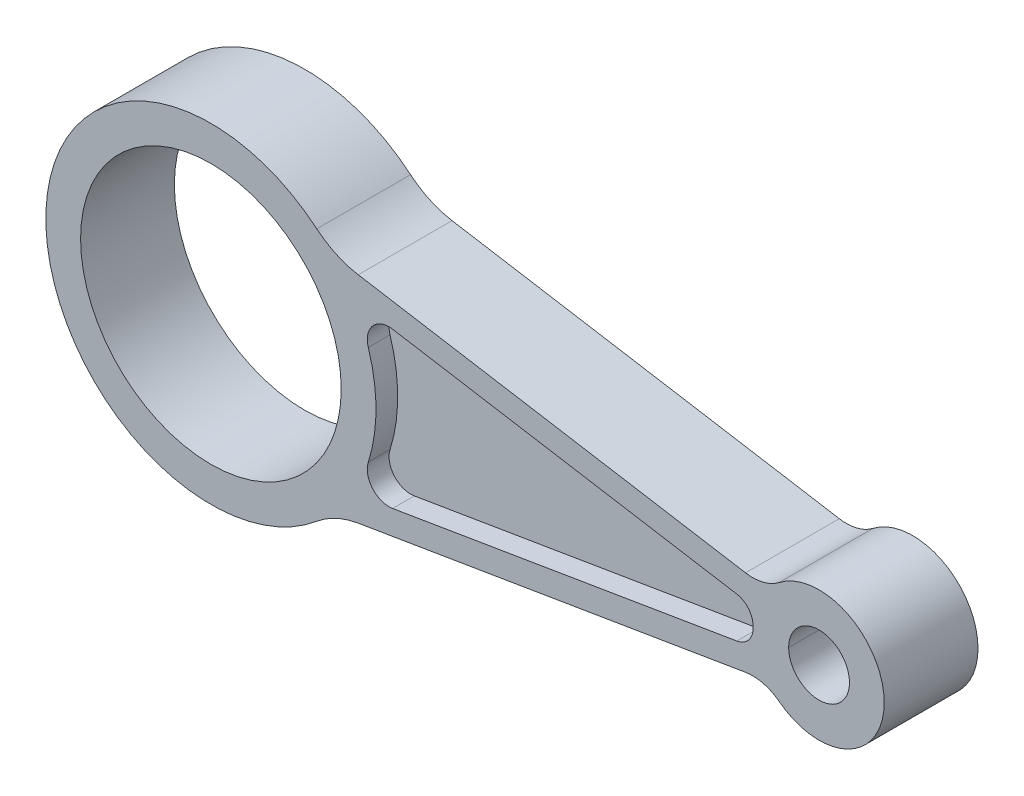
ISO-10303-21;
HEADER;
FILE_DESCRIPTION(('STEP AP214'),'2;1');
FILE_NAME('part.step','',(''),(''),'','','');
FILE_SCHEMA(('AUTOMOTIVE_DESIGN { 1 0 10303 214 1 1 1 1 }'));
ENDSEC;
DATA;
#1=APPLICATION_CONTEXT('core data for automotive mechanical design processes');
#2=APPLICATION_PROTOCOL_DEFINITION('international standard','automotive_design',2000,#1);
#3=PRODUCT_CONTEXT('',#1,'mechanical');
#4=PRODUCT('Part','Part','',(#3));
#5=PRODUCT_RELATED_PRODUCT_CATEGORY('part','',(#4));
#6=PRODUCT_DEFINITION_FORMATION('','',#4);
#7=PRODUCT_DEFINITION_CONTEXT('part definition',#1,'design');
#8=PRODUCT_DEFINITION('design','',#6,#7);
#9=PRODUCT_DEFINITION_SHAPE('','',#8);
#10=(LENGTH_UNIT() NAMED_UNIT(*) SI_UNIT(.MILLI.,.METRE.));
#11=(NAMED_UNIT(*) PLANE_ANGLE_UNIT() SI_UNIT($,.RADIAN.));
#12=(NAMED_UNIT(*) SI_UNIT($,.STERADIAN.) SOLID_ANGLE_UNIT());
#13=UNCERTAINTY_MEASURE_WITH_UNIT(LENGTH_MEASURE(1.E-05),#10,'distance_accuracy_value','');
#14=(GEOMETRIC_REPRESENTATION_CONTEXT(3) GLOBAL_UNCERTAINTY_ASSIGNED_CONTEXT((#13)) GLOBAL_UNIT_ASSIGNED_CONTEXT((#10,
#11,#12)) REPRESENTATION_CONTEXT('',''));
#15=CARTESIAN_POINT('',(0.,0.,0.));
#16=DIRECTION('',(0.,0.,1.));
#17=DIRECTION('',(1.,0.,0.));
#18=AXIS2_PLACEMENT_3D('',#15,#16,#17);
#19=CARTESIAN_POINT('',(140.,0.,-21.5898284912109));
#20=DIRECTION('',(0.,0.,1.));
#21=DIRECTION('',(1.,0.,0.));
#22=AXIS2_PLACEMENT_3D('',#19,#20,#21);
#23=CYLINDRICAL_SURFACE('',#22,7.00000000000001);
#24=DIRECTION('',(0.,0.,1.));
#25=VECTOR('',#24,1.);
#26=CARTESIAN_POINT('',(133.,0.,-21.5898284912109));
#27=LINE('',#26,#25);
#28=CARTESIAN_POINT('',(133.,0.,0.));
#29=VERTEX_POINT('',#28);
#30=CARTESIAN_POINT('',(133.,0.,-21.5898284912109));
#31=VERTEX_POINT('',#30);
#32=EDGE_CURVE('E11',#29,#31,#27,.F.);
#33=ORIENTED_EDGE('',*,*,#32,.F.);
#34=CARTESIAN_POINT('',(140.,0.,0.));
#35=DIRECTION('',(0.,0.,1.));
#36=DIRECTION('',(1.,0.,0.));
#37=AXIS2_PLACEMENT_3D('',#34,#35,#36);
#38=CIRCLE('',#37,7.00000000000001);
#39=CARTESIAN_POINT('',(147.,0.,0.));
#40=VERTEX_POINT('',#39);
#41=EDGE_CURVE('E310',#29,#40,#38,.T.);
#42=ORIENTED_EDGE('',*,*,#41,.T.);
#43=DIRECTION('',(0.,0.,1.));
#44=VECTOR('',#43,1.);
#45=CARTESIAN_POINT('',(147.,0.,-21.5898284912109));
#46=LINE('',#45,#44);
#47=CARTESIAN_POINT('',(147.,0.,-21.5898284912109));
#48=VERTEX_POINT('',#47);
#49=EDGE_CURVE('E49',#48,#40,#46,.T.);
#50=ORIENTED_EDGE('',*,*,#49,.F.);
#51=CARTESIAN_POINT('',(140.,0.,-21.5898284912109));
#52=DIRECTION('',(0.,0.,1.));
#53=DIRECTION('',(1.,0.,0.));
#54=AXIS2_PLACEMENT_3D('',#51,#52,#53);
#55=CIRCLE('',#54,7.00000000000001);
#56=EDGE_CURVE('E327',#31,#48,#55,.T.);
#57=ORIENTED_EDGE('',*,*,#56,.F.);
#58=EDGE_LOOP('',(#33,#42,#50,#57));
#59=FACE_BOUND('',#58,.T.);
#60=ADVANCED_FACE('F40',(#59),#23,.F.);
#61=CARTESIAN_POINT('',(0.,0.,-21.5898284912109));
#62=DIRECTION('',(0.,0.,1.));
#63=DIRECTION('',(1.,0.,0.));
#64=AXIS2_PLACEMENT_3D('',#61,#62,#63);
#65=CYLINDRICAL_SURFACE('',#64,38.);
#66=CARTESIAN_POINT('',(0.,0.,0.));
#67=DIRECTION('',(0.,0.,1.));
#68=DIRECTION('',(1.,0.,0.));
#69=AXIS2_PLACEMENT_3D('',#66,#67,#68);
#70=CIRCLE('',#69,38.);
#71=CARTESIAN_POINT('',(24.3781675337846,29.1496989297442,0.));
#72=VERTEX_POINT('',#71);
#73=CARTESIAN_POINT('',(24.3781675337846,-29.1496989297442,0.));
#74=VERTEX_POINT('',#73);
#75=EDGE_CURVE('E333',#72,#74,#70,.T.);
#76=ORIENTED_EDGE('',*,*,#75,.F.);
#77=DIRECTION('',(0.,0.,1.));
#78=VECTOR('',#77,1.);
#79=CARTESIAN_POINT('',(24.3781675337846,29.1496989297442,-21.5898284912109));
#80=LINE('',#79,#78);
#81=CARTESIAN_POINT('',(24.3781675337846,29.1496989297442,-21.5898284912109));
#82=VERTEX_POINT('',#81);
#83=EDGE_CURVE('E382',#72,#82,#80,.F.);
#84=ORIENTED_EDGE('',*,*,#83,.T.);
#85=CARTESIAN_POINT('',(0.,0.,-21.5898284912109));
#86=DIRECTION('',(0.,0.,1.));
#87=DIRECTION('',(1.,0.,0.));
#88=AXIS2_PLACEMENT_3D('',#85,#86,#87);
#89=CIRCLE('',#88,38.);
#90=CARTESIAN_POINT('',(24.3781675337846,-29.1496989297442,-21.5898284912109));
#91=VERTEX_POINT('',#90);
#92=EDGE_CURVE('E336',#82,#91,#89,.T.);
#93=ORIENTED_EDGE('',*,*,#92,.T.);
#94=DIRECTION('',(0.,0.,1.));
#95=VECTOR('',#94,1.);
#96=CARTESIAN_POINT('',(24.3781675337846,-29.1496989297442,-21.5898284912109));
#97=LINE('',#96,#95);
#98=EDGE_CURVE('E379',#91,#74,#97,.T.);
#99=ORIENTED_EDGE('',*,*,#98,.T.);
#100=EDGE_LOOP('',(#76,#84,#93,#99));
#101=FACE_BOUND('',#100,.T.);
#102=ADVANCED_FACE('F409',(#101),#65,.T.);
#103=CARTESIAN_POINT('',(27.9354736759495,25.7606154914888,-21.5898284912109));
#104=DIRECTION('',(0.164285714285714,0.986412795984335,0.));
#105=DIRECTION('',(-0.986412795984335,0.164285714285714,0.));
#106=AXIS2_PLACEMENT_3D('',#103,#104,#105);
#107=PLANE('',#106);
#108=DIRECTION('',(-0.986412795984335,0.164285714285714,0.));
#109=VECTOR('',#108,1.);
#110=CARTESIAN_POINT('',(27.9354736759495,25.7606154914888,-21.5898284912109));
#111=LINE('',#110,#109);
#112=CARTESIAN_POINT('',(123.068754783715,9.91629645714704,-21.5898284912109));
#113=VERTEX_POINT('',#112);
#114=CARTESIAN_POINT('',(33.9230677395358,24.7633898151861,-21.5898284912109));
#115=VERTEX_POINT('',#114);
#116=EDGE_CURVE('E345',#113,#115,#111,.T.);
#117=ORIENTED_EDGE('',*,*,#116,.T.);
#118=DIRECTION('',(0.,0.,-1.));
#119=VECTOR('',#118,1.);
#120=CARTESIAN_POINT('',(33.9230677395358,24.7633898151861,0.));
#121=LINE('',#120,#119);
#122=CARTESIAN_POINT('',(33.9230677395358,24.7633898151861,0.));
#123=VERTEX_POINT('',#122);
#124=EDGE_CURVE('E376',#115,#123,#121,.F.);
#125=ORIENTED_EDGE('',*,*,#124,.T.);
#126=DIRECTION('',(-0.986412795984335,0.164285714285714,0.));
#127=VECTOR('',#126,1.);
#128=CARTESIAN_POINT('',(27.9354736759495,25.7606154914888,0.));
#129=LINE('',#128,#127);
#130=CARTESIAN_POINT('',(123.068754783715,9.91629645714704,0.));
#131=VERTEX_POINT('',#130);
#132=EDGE_CURVE('E340',#131,#123,#129,.T.);
#133=ORIENTED_EDGE('',*,*,#132,.F.);
#134=DIRECTION('',(0.,0.,-1.));
#135=VECTOR('',#134,1.);
#136=CARTESIAN_POINT('',(123.068754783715,9.91629645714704,-21.5898284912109));
#137=LINE('',#136,#135);
#138=EDGE_CURVE('E362',#131,#113,#137,.T.);
#139=ORIENTED_EDGE('',*,*,#138,.T.);
#140=EDGE_LOOP('',(#117,#125,#133,#139));
#141=FACE_BOUND('',#140,.T.);
#142=ADVANCED_FACE('F433',(#141),#107,.T.);
#143=CARTESIAN_POINT('',(140.,0.,-21.5898284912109));
#144=DIRECTION('',(0.,0.,1.));
#145=DIRECTION('',(1.,0.,0.));
#146=AXIS2_PLACEMENT_3D('',#143,#144,#145);
#147=CYLINDRICAL_SURFACE('',#146,15.);
#148=CARTESIAN_POINT('',(140.,0.,-21.5898284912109));
#149=DIRECTION('',(0.,0.,1.));
#150=DIRECTION('',(1.,0.,0.));
#151=AXIS2_PLACEMENT_3D('',#148,#149,#150);
#152=CIRCLE('',#151,15.);
#153=CARTESIAN_POINT('',(130.826967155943,-11.8682546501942,-21.5898284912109));
#154=VERTEX_POINT('',#153);
#155=CARTESIAN_POINT('',(130.826967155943,11.8682546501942,-21.5898284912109));
#156=VERTEX_POINT('',#155);
#157=EDGE_CURVE('E342',#154,#156,#152,.T.);
#158=ORIENTED_EDGE('',*,*,#157,.T.);
#159=DIRECTION('',(0.,0.,1.));
#160=VECTOR('',#159,1.);
#161=CARTESIAN_POINT('',(130.826967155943,11.8682546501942,-21.5898284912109));
#162=LINE('',#161,#160);
#163=CARTESIAN_POINT('',(130.826967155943,11.8682546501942,0.));
#164=VERTEX_POINT('',#163);
#165=EDGE_CURVE('E359',#156,#164,#162,.T.);
#166=ORIENTED_EDGE('',*,*,#165,.T.);
#167=CARTESIAN_POINT('',(140.,0.,0.));
#168=DIRECTION('',(0.,0.,1.));
#169=DIRECTION('',(1.,0.,0.));
#170=AXIS2_PLACEMENT_3D('',#167,#168,#169);
#171=CIRCLE('',#170,15.);
#172=CARTESIAN_POINT('',(130.826967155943,-11.8682546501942,0.));
#173=VERTEX_POINT('',#172);
#174=EDGE_CURVE('E353',#173,#164,#171,.T.);
#175=ORIENTED_EDGE('',*,*,#174,.F.);
#176=DIRECTION('',(0.,0.,1.));
#177=VECTOR('',#176,1.);
#178=CARTESIAN_POINT('',(130.826967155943,-11.8682546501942,-21.5898284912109));
#179=LINE('',#178,#177);
#180=EDGE_CURVE('E348',#173,#154,#179,.F.);
#181=ORIENTED_EDGE('',*,*,#180,.T.);
#182=EDGE_LOOP('',(#158,#166,#175,#181));
#183=FACE_BOUND('',#182,.T.);
#184=ADVANCED_FACE('F424',(#183),#147,.T.);
#185=CARTESIAN_POINT('',(27.9354736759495,-25.7606154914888,-21.5898284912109));
#186=DIRECTION('',(0.164285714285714,-0.986412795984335,0.));
#187=DIRECTION('',(0.986412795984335,0.164285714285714,0.));
#188=AXIS2_PLACEMENT_3D('',#185,#186,#187);
#189=PLANE('',#188);
#190=DIRECTION('',(0.986412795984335,0.164285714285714,0.));
#191=VECTOR('',#190,1.);
#192=CARTESIAN_POINT('',(27.9354736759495,-25.7606154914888,0.));
#193=LINE('',#192,#191);
#194=CARTESIAN_POINT('',(33.9230677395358,-24.7633898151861,0.));
#195=VERTEX_POINT('',#194);
#196=CARTESIAN_POINT('',(123.068754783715,-9.91629645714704,0.));
#197=VERTEX_POINT('',#196);
#198=EDGE_CURVE('E351',#195,#197,#193,.T.);
#199=ORIENTED_EDGE('',*,*,#198,.F.);
#200=DIRECTION('',(0.,0.,-1.));
#201=VECTOR('',#200,1.);
#202=CARTESIAN_POINT('',(33.9230677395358,-24.7633898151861,-21.5898284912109));
#203=LINE('',#202,#201);
#204=CARTESIAN_POINT('',(33.9230677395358,-24.7633898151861,-21.5898284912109));
#205=VERTEX_POINT('',#204);
#206=EDGE_CURVE('E384',#195,#205,#203,.T.);
#207=ORIENTED_EDGE('',*,*,#206,.T.);
#208=DIRECTION('',(0.986412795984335,0.164285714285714,0.));
#209=VECTOR('',#208,1.);
#210=CARTESIAN_POINT('',(27.9354736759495,-25.7606154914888,-21.5898284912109));
#211=LINE('',#210,#209);
#212=CARTESIAN_POINT('',(123.068754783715,-9.91629645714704,-21.5898284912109));
#213=VERTEX_POINT('',#212);
#214=EDGE_CURVE('E339',#205,#213,#211,.T.);
#215=ORIENTED_EDGE('',*,*,#214,.T.);
#216=DIRECTION('',(0.,0.,-1.));
#217=VECTOR('',#216,1.);
#218=CARTESIAN_POINT('',(123.068754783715,-9.91629645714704,0.));
#219=LINE('',#218,#217);
#220=EDGE_CURVE('E364',#213,#197,#219,.F.);
#221=ORIENTED_EDGE('',*,*,#220,.T.);
#222=EDGE_LOOP('',(#199,#207,#215,#221));
#223=FACE_BOUND('',#222,.T.);
#224=ADVANCED_FACE('F416',(#223),#189,.T.);
#225=CARTESIAN_POINT('',(0.,0.,-21.5898284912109));
#226=DIRECTION('',(0.,0.,1.));
#227=DIRECTION('',(1.,0.,0.));
#228=AXIS2_PLACEMENT_3D('',#225,#226,#227);
#229=PLANE('',#228);
#230=DIRECTION('',(0.986412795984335,-0.164285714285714,0.));
#231=VECTOR('',#230,1.);
#232=CARTESIAN_POINT('',(121.445609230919,4.61087017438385,-21.5898284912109));
#233=LINE('',#232,#231);
#234=CARTESIAN_POINT('',(41.8285545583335,17.8709827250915,-21.5898284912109));
#235=VERTEX_POINT('',#234);
#236=CARTESIAN_POINT('',(121.445609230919,4.61087017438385,-21.5898284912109));
#237=VERTEX_POINT('',#236);
#238=EDGE_CURVE('E242',#235,#237,#233,.T.);
#239=ORIENTED_EDGE('',*,*,#238,.F.);
#240=CARTESIAN_POINT('',(41.0071259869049,12.9389187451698,-21.5898284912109));
#241=DIRECTION('',(0.,0.,-1.));
#242=DIRECTION('',(1.,0.,0.));
#243=AXIS2_PLACEMENT_3D('',#240,#241,#242);
#244=CIRCLE('',#243,5.);
#245=CARTESIAN_POINT('',(36.2388555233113,11.4343933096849,-21.5898284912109));
#246=VERTEX_POINT('',#245);
#247=EDGE_CURVE('E207',#246,#235,#244,.T.);
#248=ORIENTED_EDGE('',*,*,#247,.F.);
#249=CARTESIAN_POINT('',(0.,0.,-21.5898284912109));
#250=DIRECTION('',(0.,0.,1.));
#251=DIRECTION('',(-1.,0.,0.));
#252=AXIS2_PLACEMENT_3D('',#249,#250,#251);
#253=CIRCLE('',#252,38.);
#254=CARTESIAN_POINT('',(36.2388555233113,-11.4343933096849,-21.5898284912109));
#255=VERTEX_POINT('',#254);
#256=EDGE_CURVE('E225',#255,#246,#253,.T.);
#257=ORIENTED_EDGE('',*,*,#256,.F.);
#258=CARTESIAN_POINT('',(41.0071259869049,-12.9389187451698,-21.5898284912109));
#259=DIRECTION('',(0.,0.,-1.));
#260=DIRECTION('',(-1.,0.,0.));
#261=AXIS2_PLACEMENT_3D('',#258,#259,#260);
#262=CIRCLE('',#261,5.);
#263=CARTESIAN_POINT('',(41.8285545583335,-17.8709827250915,-21.5898284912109));
#264=VERTEX_POINT('',#263);
#265=EDGE_CURVE('E228',#264,#255,#262,.T.);
#266=ORIENTED_EDGE('',*,*,#265,.F.);
#267=DIRECTION('',(-0.986412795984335,-0.164285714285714,0.));
#268=VECTOR('',#267,1.);
#269=CARTESIAN_POINT('',(121.433526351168,-4.61288256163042,-21.5898284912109));
#270=LINE('',#269,#268);
#271=CARTESIAN_POINT('',(121.433526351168,-4.61288256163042,-21.5898284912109));
#272=VERTEX_POINT('',#271);
#273=EDGE_CURVE('E250',#272,#264,#270,.T.);
#274=ORIENTED_EDGE('',*,*,#273,.F.);
#275=CARTESIAN_POINT('',(120.694240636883,-0.174024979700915,-21.5898284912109));
#276=DIRECTION('',(0.,0.,-1.));
#277=DIRECTION('',(-1.,0.,0.));
#278=AXIS2_PLACEMENT_3D('',#275,#276,#277);
#279=CIRCLE('',#278,4.5);
#280=CARTESIAN_POINT('',(125.194211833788,-0.157924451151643,-21.5898284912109));
#281=VERTEX_POINT('',#280);
#282=EDGE_CURVE('E247',#281,#272,#279,.T.);
#283=ORIENTED_EDGE('',*,*,#282,.F.);
#284=CARTESIAN_POINT('',(120.706323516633,0.172012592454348,-21.5898284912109));
#285=DIRECTION('',(0.,0.,-1.));
#286=DIRECTION('',(1.,0.,0.));
#287=AXIS2_PLACEMENT_3D('',#284,#285,#286);
#288=CIRCLE('',#287,4.5);
#289=EDGE_CURVE('E244',#237,#281,#288,.T.);
#290=ORIENTED_EDGE('',*,*,#289,.F.);
#291=EDGE_LOOP('',(#239,#248,#257,#266,#274,#283,#290));
#292=FACE_BOUND('',#291,.T.);
#293=EDGE_CURVE('E323',#48,#31,#55,.T.);
#294=ORIENTED_EDGE('',*,*,#293,.T.);
#295=ORIENTED_EDGE('',*,*,#56,.T.);
#296=EDGE_LOOP('',(#294,#295));
#297=FACE_BOUND('',#296,.T.);
#298=CARTESIAN_POINT('',(0.,0.,-21.5898284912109));
#299=DIRECTION('',(0.,0.,1.));
#300=DIRECTION('',(1.,0.,0.));
#301=AXIS2_PLACEMENT_3D('',#298,#299,#300);
#302=CIRCLE('',#301,30.);
#303=CARTESIAN_POINT('',(30.,0.,-21.5898284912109));
#304=VERTEX_POINT('',#303);
#305=EDGE_CURVE('E330',#304,#304,#302,.T.);
#306=ORIENTED_EDGE('',*,*,#305,.T.);
#307=EDGE_LOOP('',(#306));
#308=FACE_BOUND('',#307,.T.);
#309=ORIENTED_EDGE('',*,*,#92,.F.);
#310=CARTESIAN_POINT('',(37.2087820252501,44.4916457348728,-21.5898284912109));
#311=DIRECTION('',(0.,0.,1.));
#312=DIRECTION('',(1.,0.,0.));
#313=AXIS2_PLACEMENT_3D('',#310,#311,#312);
#314=CIRCLE('',#313,20.);
#315=EDGE_CURVE('E388',#82,#115,#314,.T.);
#316=ORIENTED_EDGE('',*,*,#315,.T.);
#317=ORIENTED_EDGE('',*,*,#116,.F.);
#318=CARTESIAN_POINT('',(124.711611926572,19.7804244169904,-21.5898284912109));
#319=DIRECTION('',(0.,0.,1.));
#320=DIRECTION('',(1.,0.,0.));
#321=AXIS2_PLACEMENT_3D('',#318,#319,#320);
#322=CIRCLE('',#321,10.);
#323=EDGE_CURVE('E369',#113,#156,#322,.T.);
#324=ORIENTED_EDGE('',*,*,#323,.T.);
#325=ORIENTED_EDGE('',*,*,#157,.F.);
#326=CARTESIAN_POINT('',(124.711611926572,-19.7804244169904,-21.5898284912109));
#327=DIRECTION('',(0.,0.,1.));
#328=DIRECTION('',(1.,0.,0.));
#329=AXIS2_PLACEMENT_3D('',#326,#327,#328);
#330=CIRCLE('',#329,10.);
#331=EDGE_CURVE('E373',#154,#213,#330,.T.);
#332=ORIENTED_EDGE('',*,*,#331,.T.);
#333=ORIENTED_EDGE('',*,*,#214,.F.);
#334=CARTESIAN_POINT('',(37.2087820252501,-44.4916457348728,-21.5898284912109));
#335=DIRECTION('',(0.,0.,1.));
#336=DIRECTION('',(1.,0.,0.));
#337=AXIS2_PLACEMENT_3D('',#334,#335,#336);
#338=CIRCLE('',#337,20.);
#339=EDGE_CURVE('E392',#205,#91,#338,.T.);
#340=ORIENTED_EDGE('',*,*,#339,.T.);
#341=EDGE_LOOP('',(#309,#316,#317,#324,#325,#332,#333,#340));
#342=FACE_BOUND('',#341,.T.);
#343=ADVANCED_FACE('F402',(#292,#297,#308,#342),#229,.F.);
#344=CARTESIAN_POINT('',(0.,0.,0.));
#345=DIRECTION('',(0.,0.,1.));
#346=DIRECTION('',(1.,0.,0.));
#347=AXIS2_PLACEMENT_3D('',#344,#345,#346);
#348=PLANE('',#347);
#349=CARTESIAN_POINT('',(41.0071259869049,12.9389187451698,0.));
#350=DIRECTION('',(0.,0.,1.));
#351=DIRECTION('',(-1.,0.,0.));
#352=AXIS2_PLACEMENT_3D('',#349,#350,#351);
#353=CIRCLE('',#352,5.);
#354=CARTESIAN_POINT('',(41.8285545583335,17.8709827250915,0.));
#355=VERTEX_POINT('',#354);
#356=CARTESIAN_POINT('',(36.2388555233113,11.4343933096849,0.));
#357=VERTEX_POINT('',#356);
#358=EDGE_CURVE('E257',#355,#357,#353,.T.);
#359=ORIENTED_EDGE('',*,*,#358,.F.);
#360=DIRECTION('',(-0.986412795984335,0.164285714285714,0.));
#361=VECTOR('',#360,1.);
#362=CARTESIAN_POINT('',(41.8285545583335,17.8709827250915,0.));
#363=LINE('',#362,#361);
#364=CARTESIAN_POINT('',(121.046940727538,4.67726787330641,0.));
#365=VERTEX_POINT('',#364);
#366=EDGE_CURVE('E271',#365,#355,#363,.T.);
#367=ORIENTED_EDGE('',*,*,#366,.F.);
#368=CARTESIAN_POINT('',(120.307655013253,0.238410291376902,0.));
#369=DIRECTION('',(0.,0.,1.));
#370=DIRECTION('',(1.,0.,0.));
#371=AXIS2_PLACEMENT_3D('',#368,#369,#370);
#372=CIRCLE('',#371,4.5);
#373=CARTESIAN_POINT('',(124.807655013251,0.238406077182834,0.));
#374=VERTEX_POINT('',#373);
#375=EDGE_CURVE('E303',#374,#365,#372,.T.);
#376=ORIENTED_EDGE('',*,*,#375,.F.);
#377=CARTESIAN_POINT('',(120.332548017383,-0.234264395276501,0.));
#378=DIRECTION('',(0.,0.,1.));
#379=DIRECTION('',(-1.,0.,0.));
#380=AXIS2_PLACEMENT_3D('',#377,#378,#379);
#381=CIRCLE('',#380,4.5);
#382=CARTESIAN_POINT('',(121.071833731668,-4.67312197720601,0.));
#383=VERTEX_POINT('',#382);
#384=EDGE_CURVE('E300',#383,#374,#381,.T.);
#385=ORIENTED_EDGE('',*,*,#384,.F.);
#386=DIRECTION('',(0.986412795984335,0.164285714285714,0.));
#387=VECTOR('',#386,1.);
#388=CARTESIAN_POINT('',(41.8285545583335,-17.8709827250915,0.));
#389=LINE('',#388,#387);
#390=CARTESIAN_POINT('',(41.8285545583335,-17.8709827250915,0.));
#391=VERTEX_POINT('',#390);
#392=EDGE_CURVE('E297',#391,#383,#389,.T.);
#393=ORIENTED_EDGE('',*,*,#392,.F.);
#394=CARTESIAN_POINT('',(41.0071259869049,-12.9389187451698,0.));
#395=DIRECTION('',(0.,0.,1.));
#396=DIRECTION('',(-1.,0.,0.));
#397=AXIS2_PLACEMENT_3D('',#394,#395,#396);
#398=CIRCLE('',#397,5.);
#399=CARTESIAN_POINT('',(36.2388555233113,-11.4343933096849,0.));
#400=VERTEX_POINT('',#399);
#401=EDGE_CURVE('E294',#400,#391,#398,.T.);
#402=ORIENTED_EDGE('',*,*,#401,.F.);
#403=CARTESIAN_POINT('',(0.,0.,0.));
#404=DIRECTION('',(0.,0.,-1.));
#405=DIRECTION('',(1.,0.,0.));
#406=AXIS2_PLACEMENT_3D('',#403,#404,#405);
#407=CIRCLE('',#406,38.);
#408=EDGE_CURVE('E291',#357,#400,#407,.T.);
#409=ORIENTED_EDGE('',*,*,#408,.F.);
#410=EDGE_LOOP('',(#359,#367,#376,#385,#393,#402,#409));
#411=FACE_BOUND('',#410,.T.);
#412=EDGE_CURVE('E328',#40,#29,#38,.T.);
#413=ORIENTED_EDGE('',*,*,#412,.F.);
#414=ORIENTED_EDGE('',*,*,#41,.F.);
#415=EDGE_LOOP('',(#413,#414));
#416=FACE_BOUND('',#415,.T.);
#417=CARTESIAN_POINT('',(0.,0.,0.));
#418=DIRECTION('',(0.,0.,1.));
#419=DIRECTION('',(1.,0.,0.));
#420=AXIS2_PLACEMENT_3D('',#417,#418,#419);
#421=CIRCLE('',#420,30.);
#422=CARTESIAN_POINT('',(30.,0.,0.));
#423=VERTEX_POINT('',#422);
#424=EDGE_CURVE('E326',#423,#423,#421,.T.);
#425=ORIENTED_EDGE('',*,*,#424,.F.);
#426=EDGE_LOOP('',(#425));
#427=FACE_BOUND('',#426,.T.);
#428=ORIENTED_EDGE('',*,*,#132,.T.);
#429=CARTESIAN_POINT('',(37.2087820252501,44.4916457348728,0.));
#430=DIRECTION('',(0.,0.,1.));
#431=DIRECTION('',(1.,0.,0.));
#432=AXIS2_PLACEMENT_3D('',#429,#430,#431);
#433=CIRCLE('',#432,20.);
#434=EDGE_CURVE('E386',#123,#72,#433,.F.);
#435=ORIENTED_EDGE('',*,*,#434,.T.);
#436=ORIENTED_EDGE('',*,*,#75,.T.);
#437=CARTESIAN_POINT('',(37.2087820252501,-44.4916457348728,0.));
#438=DIRECTION('',(0.,0.,1.));
#439=DIRECTION('',(1.,0.,0.));
#440=AXIS2_PLACEMENT_3D('',#437,#438,#439);
#441=CIRCLE('',#440,20.);
#442=EDGE_CURVE('E390',#74,#195,#441,.F.);
#443=ORIENTED_EDGE('',*,*,#442,.T.);
#444=ORIENTED_EDGE('',*,*,#198,.T.);
#445=CARTESIAN_POINT('',(124.711611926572,-19.7804244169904,0.));
#446=DIRECTION('',(0.,0.,1.));
#447=DIRECTION('',(1.,0.,0.));
#448=AXIS2_PLACEMENT_3D('',#445,#446,#447);
#449=CIRCLE('',#448,10.);
#450=EDGE_CURVE('E371',#197,#173,#449,.F.);
#451=ORIENTED_EDGE('',*,*,#450,.T.);
#452=ORIENTED_EDGE('',*,*,#174,.T.);
#453=CARTESIAN_POINT('',(124.711611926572,19.7804244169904,0.));
#454=DIRECTION('',(0.,0.,1.));
#455=DIRECTION('',(1.,0.,0.));
#456=AXIS2_PLACEMENT_3D('',#453,#454,#455);
#457=CIRCLE('',#456,10.);
#458=EDGE_CURVE('E367',#164,#131,#457,.F.);
#459=ORIENTED_EDGE('',*,*,#458,.T.);
#460=EDGE_LOOP('',(#428,#435,#436,#443,#444,#451,#452,#459));
#461=FACE_BOUND('',#460,.T.);
#462=ADVANCED_FACE('F413',(#411,#416,#427,#461),#348,.T.);
#463=CARTESIAN_POINT('',(0.,0.,-21.5898284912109));
#464=DIRECTION('',(0.,0.,1.));
#465=DIRECTION('',(1.,0.,0.));
#466=AXIS2_PLACEMENT_3D('',#463,#464,#465);
#467=CYLINDRICAL_SURFACE('',#466,30.);
#468=ORIENTED_EDGE('',*,*,#305,.F.);
#469=EDGE_LOOP('',(#468));
#470=FACE_BOUND('',#469,.T.);
#471=ORIENTED_EDGE('',*,*,#424,.T.);
#472=EDGE_LOOP('',(#471));
#473=FACE_BOUND('',#472,.T.);
#474=ADVANCED_FACE('F455',(#470,#473),#467,.F.);
#475=ORIENTED_EDGE('',*,*,#412,.T.);
#476=ORIENTED_EDGE('',*,*,#32,.T.);
#477=ORIENTED_EDGE('',*,*,#293,.F.);
#478=ORIENTED_EDGE('',*,*,#49,.T.);
#479=EDGE_LOOP('',(#475,#476,#477,#478));
#480=FACE_BOUND('',#479,.T.);
#481=ADVANCED_FACE('F447',(#480),#23,.F.);
#482=CARTESIAN_POINT('',(124.711611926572,19.7804244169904,-21.5898284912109));
#483=DIRECTION('',(0.,0.,1.));
#484=DIRECTION('',(1.,0.,0.));
#485=AXIS2_PLACEMENT_3D('',#482,#483,#484);
#486=CYLINDRICAL_SURFACE('',#485,10.);
#487=ORIENTED_EDGE('',*,*,#323,.F.);
#488=ORIENTED_EDGE('',*,*,#138,.F.);
#489=ORIENTED_EDGE('',*,*,#458,.F.);
#490=ORIENTED_EDGE('',*,*,#165,.F.);
#491=EDGE_LOOP('',(#487,#488,#489,#490));
#492=FACE_BOUND('',#491,.T.);
#493=ADVANCED_FACE('F429',(#492),#486,.F.);
#494=CARTESIAN_POINT('',(124.711611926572,-19.7804244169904,-21.5898284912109));
#495=DIRECTION('',(0.,0.,1.));
#496=DIRECTION('',(1.,0.,0.));
#497=AXIS2_PLACEMENT_3D('',#494,#495,#496);
#498=CYLINDRICAL_SURFACE('',#497,10.);
#499=ORIENTED_EDGE('',*,*,#331,.F.);
#500=ORIENTED_EDGE('',*,*,#180,.F.);
#501=ORIENTED_EDGE('',*,*,#450,.F.);
#502=ORIENTED_EDGE('',*,*,#220,.F.);
#503=EDGE_LOOP('',(#499,#500,#501,#502));
#504=FACE_BOUND('',#503,.T.);
#505=ADVANCED_FACE('F420',(#504),#498,.F.);
#506=CARTESIAN_POINT('',(37.2087820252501,44.4916457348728,-21.5898284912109));
#507=DIRECTION('',(0.,0.,1.));
#508=DIRECTION('',(1.,0.,0.));
#509=AXIS2_PLACEMENT_3D('',#506,#507,#508);
#510=CYLINDRICAL_SURFACE('',#509,20.);
#511=ORIENTED_EDGE('',*,*,#315,.F.);
#512=ORIENTED_EDGE('',*,*,#83,.F.);
#513=ORIENTED_EDGE('',*,*,#434,.F.);
#514=ORIENTED_EDGE('',*,*,#124,.F.);
#515=EDGE_LOOP('',(#511,#512,#513,#514));
#516=FACE_BOUND('',#515,.T.);
#517=ADVANCED_FACE('F437',(#516),#510,.F.);
#518=CARTESIAN_POINT('',(37.2087820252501,-44.4916457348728,-21.5898284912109));
#519=DIRECTION('',(0.,0.,1.));
#520=DIRECTION('',(1.,0.,0.));
#521=AXIS2_PLACEMENT_3D('',#518,#519,#520);
#522=CYLINDRICAL_SURFACE('',#521,20.);
#523=ORIENTED_EDGE('',*,*,#339,.F.);
#524=ORIENTED_EDGE('',*,*,#206,.F.);
#525=ORIENTED_EDGE('',*,*,#442,.F.);
#526=ORIENTED_EDGE('',*,*,#98,.F.);
#527=EDGE_LOOP('',(#523,#524,#525,#526));
#528=FACE_BOUND('',#527,.T.);
#529=ADVANCED_FACE('F42',(#528),#522,.F.);
#530=CARTESIAN_POINT('',(41.0071259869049,12.9389187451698,-5.));
#531=DIRECTION('',(0.,0.,1.));
#532=DIRECTION('',(1.,0.,0.));
#533=AXIS2_PLACEMENT_3D('',#530,#531,#532);
#534=CYLINDRICAL_SURFACE('',#533,5.);
#535=ORIENTED_EDGE('',*,*,#358,.T.);
#536=DIRECTION('',(0.,0.,1.));
#537=VECTOR('',#536,1.);
#538=CARTESIAN_POINT('',(36.2388555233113,11.4343933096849,-5.));
#539=LINE('',#538,#537);
#540=CARTESIAN_POINT('',(36.2388555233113,11.4343933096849,-5.));
#541=VERTEX_POINT('',#540);
#542=EDGE_CURVE('E289',#541,#357,#539,.T.);
#543=ORIENTED_EDGE('',*,*,#542,.F.);
#544=CARTESIAN_POINT('',(41.0071259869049,12.9389187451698,-5.));
#545=DIRECTION('',(0.,0.,1.));
#546=DIRECTION('',(-1.,0.,0.));
#547=AXIS2_PLACEMENT_3D('',#544,#545,#546);
#548=CIRCLE('',#547,5.);
#549=CARTESIAN_POINT('',(41.8285545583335,17.8709827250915,-5.));
#550=VERTEX_POINT('',#549);
#551=EDGE_CURVE('E267',#550,#541,#548,.T.);
#552=ORIENTED_EDGE('',*,*,#551,.F.);
#553=DIRECTION('',(0.,0.,1.));
#554=VECTOR('',#553,1.);
#555=CARTESIAN_POINT('',(41.8285545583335,17.8709827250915,-5.));
#556=LINE('',#555,#554);
#557=EDGE_CURVE('E308',#550,#355,#556,.T.);
#558=ORIENTED_EDGE('',*,*,#557,.T.);
#559=EDGE_LOOP('',(#535,#543,#552,#558));
#560=FACE_BOUND('',#559,.T.);
#561=ADVANCED_FACE('F443',(#560),#534,.F.);
#562=CARTESIAN_POINT('',(41.8285545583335,17.8709827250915,-5.));
#563=DIRECTION('',(0.164285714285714,0.986412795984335,0.));
#564=DIRECTION('',(-0.986412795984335,0.164285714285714,0.));
#565=AXIS2_PLACEMENT_3D('',#562,#563,#564);
#566=PLANE('',#565);
#567=ORIENTED_EDGE('',*,*,#366,.T.);
#568=ORIENTED_EDGE('',*,*,#557,.F.);
#569=DIRECTION('',(-0.986412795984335,0.164285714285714,0.));
#570=VECTOR('',#569,1.);
#571=CARTESIAN_POINT('',(41.8285545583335,17.8709827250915,-5.));
#572=LINE('',#571,#570);
#573=CARTESIAN_POINT('',(121.046940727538,4.67726787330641,-5.));
#574=VERTEX_POINT('',#573);
#575=EDGE_CURVE('E286',#574,#550,#572,.T.);
#576=ORIENTED_EDGE('',*,*,#575,.F.);
#577=DIRECTION('',(0.,0.,1.));
#578=VECTOR('',#577,1.);
#579=CARTESIAN_POINT('',(121.046940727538,4.67726787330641,-5.));
#580=LINE('',#579,#578);
#581=EDGE_CURVE('E311',#574,#365,#580,.T.);
#582=ORIENTED_EDGE('',*,*,#581,.T.);
#583=EDGE_LOOP('',(#567,#568,#576,#582));
#584=FACE_BOUND('',#583,.T.);
#585=ADVANCED_FACE('F532',(#584),#566,.F.);
#586=CARTESIAN_POINT('',(120.307655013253,0.238410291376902,-5.));
#587=DIRECTION('',(0.,0.,1.));
#588=DIRECTION('',(1.,0.,0.));
#589=AXIS2_PLACEMENT_3D('',#586,#587,#588);
#590=CYLINDRICAL_SURFACE('',#589,4.5);
#591=ORIENTED_EDGE('',*,*,#375,.T.);
#592=ORIENTED_EDGE('',*,*,#581,.F.);
#593=CARTESIAN_POINT('',(120.307655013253,0.238410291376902,-5.));
#594=DIRECTION('',(0.,0.,1.));
#595=DIRECTION('',(1.,0.,0.));
#596=AXIS2_PLACEMENT_3D('',#593,#594,#595);
#597=CIRCLE('',#596,4.5);
#598=CARTESIAN_POINT('',(124.807655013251,0.238406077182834,-5.));
#599=VERTEX_POINT('',#598);
#600=EDGE_CURVE('E283',#599,#574,#597,.T.);
#601=ORIENTED_EDGE('',*,*,#600,.F.);
#602=DIRECTION('',(0.,0.,1.));
#603=VECTOR('',#602,1.);
#604=CARTESIAN_POINT('',(124.807655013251,0.238406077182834,-5.));
#605=LINE('',#604,#603);
#606=EDGE_CURVE('E313',#599,#374,#605,.T.);
#607=ORIENTED_EDGE('',*,*,#606,.T.);
#608=EDGE_LOOP('',(#591,#592,#601,#607));
#609=FACE_BOUND('',#608,.T.);
#610=ADVANCED_FACE('F540',(#609),#590,.F.);
#611=CARTESIAN_POINT('',(120.332548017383,-0.234264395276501,-5.));
#612=DIRECTION('',(0.,0.,1.));
#613=DIRECTION('',(1.,0.,0.));
#614=AXIS2_PLACEMENT_3D('',#611,#612,#613);
#615=CYLINDRICAL_SURFACE('',#614,4.5);
#616=ORIENTED_EDGE('',*,*,#384,.T.);
#617=ORIENTED_EDGE('',*,*,#606,.F.);
#618=CARTESIAN_POINT('',(120.332548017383,-0.234264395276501,-5.));
#619=DIRECTION('',(0.,0.,1.));
#620=DIRECTION('',(-1.,0.,0.));
#621=AXIS2_PLACEMENT_3D('',#618,#619,#620);
#622=CIRCLE('',#621,4.5);
#623=CARTESIAN_POINT('',(121.071833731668,-4.67312197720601,-5.));
#624=VERTEX_POINT('',#623);
#625=EDGE_CURVE('E280',#624,#599,#622,.T.);
#626=ORIENTED_EDGE('',*,*,#625,.F.);
#627=DIRECTION('',(0.,0.,1.));
#628=VECTOR('',#627,1.);
#629=CARTESIAN_POINT('',(121.071833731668,-4.67312197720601,-5.));
#630=LINE('',#629,#628);
#631=EDGE_CURVE('E315',#624,#383,#630,.T.);
#632=ORIENTED_EDGE('',*,*,#631,.T.);
#633=EDGE_LOOP('',(#616,#617,#626,#632));
#634=FACE_BOUND('',#633,.T.);
#635=ADVANCED_FACE('F549',(#634),#615,.F.);
#636=CARTESIAN_POINT('',(41.8285545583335,-17.8709827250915,-5.));
#637=DIRECTION('',(0.164285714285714,-0.986412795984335,0.));
#638=DIRECTION('',(0.986412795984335,0.164285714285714,0.));
#639=AXIS2_PLACEMENT_3D('',#636,#637,#638);
#640=PLANE('',#639);
#641=ORIENTED_EDGE('',*,*,#392,.T.);
#642=ORIENTED_EDGE('',*,*,#631,.F.);
#643=DIRECTION('',(0.986412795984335,0.164285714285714,0.));
#644=VECTOR('',#643,1.);
#645=CARTESIAN_POINT('',(41.8285545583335,-17.8709827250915,-5.));
#646=LINE('',#645,#644);
#647=CARTESIAN_POINT('',(41.8285545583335,-17.8709827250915,-5.));
#648=VERTEX_POINT('',#647);
#649=EDGE_CURVE('E277',#648,#624,#646,.T.);
#650=ORIENTED_EDGE('',*,*,#649,.F.);
#651=DIRECTION('',(0.,0.,1.));
#652=VECTOR('',#651,1.);
#653=CARTESIAN_POINT('',(41.8285545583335,-17.8709827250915,-5.));
#654=LINE('',#653,#652);
#655=EDGE_CURVE('E317',#648,#391,#654,.T.);
#656=ORIENTED_EDGE('',*,*,#655,.T.);
#657=EDGE_LOOP('',(#641,#642,#650,#656));
#658=FACE_BOUND('',#657,.T.);
#659=ADVANCED_FACE('F558',(#658),#640,.F.);
#660=CARTESIAN_POINT('',(41.0071259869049,-12.9389187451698,-5.));
#661=DIRECTION('',(0.,0.,1.));
#662=DIRECTION('',(1.,0.,0.));
#663=AXIS2_PLACEMENT_3D('',#660,#661,#662);
#664=CYLINDRICAL_SURFACE('',#663,5.);
#665=ORIENTED_EDGE('',*,*,#401,.T.);
#666=ORIENTED_EDGE('',*,*,#655,.F.);
#667=CARTESIAN_POINT('',(41.0071259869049,-12.9389187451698,-5.));
#668=DIRECTION('',(0.,0.,1.));
#669=DIRECTION('',(-1.,0.,0.));
#670=AXIS2_PLACEMENT_3D('',#667,#668,#669);
#671=CIRCLE('',#670,5.);
#672=CARTESIAN_POINT('',(36.2388555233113,-11.4343933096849,-5.));
#673=VERTEX_POINT('',#672);
#674=EDGE_CURVE('E274',#673,#648,#671,.T.);
#675=ORIENTED_EDGE('',*,*,#674,.F.);
#676=DIRECTION('',(0.,0.,1.));
#677=VECTOR('',#676,1.);
#678=CARTESIAN_POINT('',(36.2388555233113,-11.4343933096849,-5.));
#679=LINE('',#678,#677);
#680=EDGE_CURVE('E319',#673,#400,#679,.T.);
#681=ORIENTED_EDGE('',*,*,#680,.T.);
#682=EDGE_LOOP('',(#665,#666,#675,#681));
#683=FACE_BOUND('',#682,.T.);
#684=ADVANCED_FACE('F567',(#683),#664,.F.);
#685=CARTESIAN_POINT('',(0.,0.,-5.));
#686=DIRECTION('',(0.,0.,1.));
#687=DIRECTION('',(1.,0.,0.));
#688=AXIS2_PLACEMENT_3D('',#685,#686,#687);
#689=CYLINDRICAL_SURFACE('',#688,38.);
#690=ORIENTED_EDGE('',*,*,#408,.T.);
#691=ORIENTED_EDGE('',*,*,#680,.F.);
#692=CARTESIAN_POINT('',(0.,0.,-5.));
#693=DIRECTION('',(0.,0.,-1.));
#694=DIRECTION('',(1.,0.,0.));
#695=AXIS2_PLACEMENT_3D('',#692,#693,#694);
#696=CIRCLE('',#695,38.);
#697=EDGE_CURVE('E270',#541,#673,#696,.T.);
#698=ORIENTED_EDGE('',*,*,#697,.F.);
#699=ORIENTED_EDGE('',*,*,#542,.T.);
#700=EDGE_LOOP('',(#690,#691,#698,#699));
#701=FACE_BOUND('',#700,.T.);
#702=ADVANCED_FACE('F576',(#701),#689,.T.);
#703=CARTESIAN_POINT('',(41.0071259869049,12.9389187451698,-5.));
#704=DIRECTION('',(0.,0.,-1.));
#705=DIRECTION('',(-1.,0.,0.));
#706=AXIS2_PLACEMENT_3D('',#703,#704,#705);
#707=PLANE('',#706);
#708=ORIENTED_EDGE('',*,*,#551,.T.);
#709=ORIENTED_EDGE('',*,*,#697,.T.);
#710=ORIENTED_EDGE('',*,*,#674,.T.);
#711=ORIENTED_EDGE('',*,*,#649,.T.);
#712=ORIENTED_EDGE('',*,*,#625,.T.);
#713=ORIENTED_EDGE('',*,*,#600,.T.);
#714=ORIENTED_EDGE('',*,*,#575,.T.);
#715=EDGE_LOOP('',(#708,#709,#710,#711,#712,#713,#714));
#716=FACE_BOUND('',#715,.T.);
#717=ADVANCED_FACE('F585',(#716),#707,.F.);
#718=CARTESIAN_POINT('',(41.0071259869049,12.9389187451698,-16.5898284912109));
#719=DIRECTION('',(0.,0.,-1.));
#720=DIRECTION('',(-1.,0.,0.));
#721=AXIS2_PLACEMENT_3D('',#718,#719,#720);
#722=CYLINDRICAL_SURFACE('',#721,5.);
#723=ORIENTED_EDGE('',*,*,#247,.T.);
#724=DIRECTION('',(0.,0.,-1.));
#725=VECTOR('',#724,1.);
#726=CARTESIAN_POINT('',(41.8285545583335,17.8709827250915,-16.5898284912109));
#727=LINE('',#726,#725);
#728=CARTESIAN_POINT('',(41.8285545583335,17.8709827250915,-16.5898284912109));
#729=VERTEX_POINT('',#728);
#730=EDGE_CURVE('E200',#729,#235,#727,.T.);
#731=ORIENTED_EDGE('',*,*,#730,.F.);
#732=CARTESIAN_POINT('',(41.0071259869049,12.9389187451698,-16.5898284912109));
#733=DIRECTION('',(0.,0.,-1.));
#734=DIRECTION('',(1.,0.,0.));
#735=AXIS2_PLACEMENT_3D('',#732,#733,#734);
#736=CIRCLE('',#735,5.);
#737=CARTESIAN_POINT('',(36.2388555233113,11.4343933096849,-16.5898284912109));
#738=VERTEX_POINT('',#737);
#739=EDGE_CURVE('E204',#738,#729,#736,.T.);
#740=ORIENTED_EDGE('',*,*,#739,.F.);
#741=DIRECTION('',(0.,0.,-1.));
#742=VECTOR('',#741,1.);
#743=CARTESIAN_POINT('',(36.2388555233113,11.4343933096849,-16.5898284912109));
#744=LINE('',#743,#742);
#745=EDGE_CURVE('E255',#738,#246,#744,.T.);
#746=ORIENTED_EDGE('',*,*,#745,.T.);
#747=EDGE_LOOP('',(#723,#731,#740,#746));
#748=FACE_BOUND('',#747,.T.);
#749=ADVANCED_FACE('F202',(#748),#722,.F.);
#750=CARTESIAN_POINT('',(0.,0.,-16.5898284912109));
#751=DIRECTION('',(0.,0.,-1.));
#752=DIRECTION('',(-1.,0.,0.));
#753=AXIS2_PLACEMENT_3D('',#750,#751,#752);
#754=CYLINDRICAL_SURFACE('',#753,38.);
#755=ORIENTED_EDGE('',*,*,#256,.T.);
#756=ORIENTED_EDGE('',*,*,#745,.F.);
#757=CARTESIAN_POINT('',(0.,0.,-16.5898284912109));
#758=DIRECTION('',(0.,0.,1.));
#759=DIRECTION('',(-1.,0.,0.));
#760=AXIS2_PLACEMENT_3D('',#757,#758,#759);
#761=CIRCLE('',#760,38.);
#762=CARTESIAN_POINT('',(36.2388555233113,-11.4343933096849,-16.5898284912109));
#763=VERTEX_POINT('',#762);
#764=EDGE_CURVE('E212',#763,#738,#761,.T.);
#765=ORIENTED_EDGE('',*,*,#764,.F.);
#766=DIRECTION('',(0.,0.,-1.));
#767=VECTOR('',#766,1.);
#768=CARTESIAN_POINT('',(36.2388555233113,-11.4343933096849,-16.5898284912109));
#769=LINE('',#768,#767);
#770=EDGE_CURVE('E258',#763,#255,#769,.T.);
#771=ORIENTED_EDGE('',*,*,#770,.T.);
#772=EDGE_LOOP('',(#755,#756,#765,#771));
#773=FACE_BOUND('',#772,.T.);
#774=ADVANCED_FACE('F602',(#773),#754,.T.);
#775=CARTESIAN_POINT('',(41.0071259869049,-12.9389187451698,-16.5898284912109));
#776=DIRECTION('',(0.,0.,-1.));
#777=DIRECTION('',(-1.,0.,0.));
#778=AXIS2_PLACEMENT_3D('',#775,#776,#777);
#779=CYLINDRICAL_SURFACE('',#778,5.);
#780=ORIENTED_EDGE('',*,*,#265,.T.);
#781=ORIENTED_EDGE('',*,*,#770,.F.);
#782=CARTESIAN_POINT('',(41.0071259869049,-12.9389187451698,-16.5898284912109));
#783=DIRECTION('',(0.,0.,-1.));
#784=DIRECTION('',(-1.,0.,0.));
#785=AXIS2_PLACEMENT_3D('',#782,#783,#784);
#786=CIRCLE('',#785,5.);
#787=CARTESIAN_POINT('',(41.8285545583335,-17.8709827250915,-16.5898284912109));
#788=VERTEX_POINT('',#787);
#789=EDGE_CURVE('E238',#788,#763,#786,.T.);
#790=ORIENTED_EDGE('',*,*,#789,.F.);
#791=DIRECTION('',(0.,0.,-1.));
#792=VECTOR('',#791,1.);
#793=CARTESIAN_POINT('',(41.8285545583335,-17.8709827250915,-16.5898284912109));
#794=LINE('',#793,#792);
#795=EDGE_CURVE('E260',#788,#264,#794,.T.);
#796=ORIENTED_EDGE('',*,*,#795,.T.);
#797=EDGE_LOOP('',(#780,#781,#790,#796));
#798=FACE_BOUND('',#797,.T.);
#799=ADVANCED_FACE('F610',(#798),#779,.F.);
#800=CARTESIAN_POINT('',(121.433526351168,-4.61288256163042,-16.5898284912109));
#801=DIRECTION('',(0.164285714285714,-0.986412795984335,0.));
#802=DIRECTION('',(0.986412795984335,0.164285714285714,0.));
#803=AXIS2_PLACEMENT_3D('',#800,#801,#802);
#804=PLANE('',#803);
#805=ORIENTED_EDGE('',*,*,#273,.T.);
#806=ORIENTED_EDGE('',*,*,#795,.F.);
#807=DIRECTION('',(-0.986412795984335,-0.164285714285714,0.));
#808=VECTOR('',#807,1.);
#809=CARTESIAN_POINT('',(121.433526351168,-4.61288256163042,-16.5898284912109));
#810=LINE('',#809,#808);
#811=CARTESIAN_POINT('',(121.433526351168,-4.61288256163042,-16.5898284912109));
#812=VERTEX_POINT('',#811);
#813=EDGE_CURVE('E235',#812,#788,#810,.T.);
#814=ORIENTED_EDGE('',*,*,#813,.F.);
#815=DIRECTION('',(0.,0.,-1.));
#816=VECTOR('',#815,1.);
#817=CARTESIAN_POINT('',(121.433526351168,-4.61288256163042,-16.5898284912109));
#818=LINE('',#817,#816);
#819=EDGE_CURVE('E262',#812,#272,#818,.T.);
#820=ORIENTED_EDGE('',*,*,#819,.T.);
#821=EDGE_LOOP('',(#805,#806,#814,#820));
#822=FACE_BOUND('',#821,.T.);
#823=ADVANCED_FACE('F619',(#822),#804,.F.);
#824=CARTESIAN_POINT('',(120.694240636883,-0.174024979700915,-16.5898284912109));
#825=DIRECTION('',(0.,0.,-1.));
#826=DIRECTION('',(-1.,0.,0.));
#827=AXIS2_PLACEMENT_3D('',#824,#825,#826);
#828=CYLINDRICAL_SURFACE('',#827,4.5);
#829=ORIENTED_EDGE('',*,*,#282,.T.);
#830=ORIENTED_EDGE('',*,*,#819,.F.);
#831=CARTESIAN_POINT('',(120.694240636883,-0.174024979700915,-16.5898284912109));
#832=DIRECTION('',(0.,0.,-1.));
#833=DIRECTION('',(-1.,0.,0.));
#834=AXIS2_PLACEMENT_3D('',#831,#832,#833);
#835=CIRCLE('',#834,4.5);
#836=CARTESIAN_POINT('',(125.194211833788,-0.157924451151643,-16.5898284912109));
#837=VERTEX_POINT('',#836);
#838=EDGE_CURVE('E232',#837,#812,#835,.T.);
#839=ORIENTED_EDGE('',*,*,#838,.F.);
#840=DIRECTION('',(0.,0.,-1.));
#841=VECTOR('',#840,1.);
#842=CARTESIAN_POINT('',(125.194211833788,-0.157924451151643,-16.5898284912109));
#843=LINE('',#842,#841);
#844=EDGE_CURVE('E264',#837,#281,#843,.T.);
#845=ORIENTED_EDGE('',*,*,#844,.T.);
#846=EDGE_LOOP('',(#829,#830,#839,#845));
#847=FACE_BOUND('',#846,.T.);
#848=ADVANCED_FACE('F628',(#847),#828,.F.);
#849=CARTESIAN_POINT('',(120.706323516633,0.172012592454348,-16.5898284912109));
#850=DIRECTION('',(0.,0.,-1.));
#851=DIRECTION('',(-1.,0.,0.));
#852=AXIS2_PLACEMENT_3D('',#849,#850,#851);
#853=CYLINDRICAL_SURFACE('',#852,4.5);
#854=ORIENTED_EDGE('',*,*,#289,.T.);
#855=ORIENTED_EDGE('',*,*,#844,.F.);
#856=CARTESIAN_POINT('',(120.706323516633,0.172012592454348,-16.5898284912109));
#857=DIRECTION('',(0.,0.,-1.));
#858=DIRECTION('',(1.,0.,0.));
#859=AXIS2_PLACEMENT_3D('',#856,#857,#858);
#860=CIRCLE('',#859,4.5);
#861=CARTESIAN_POINT('',(121.445609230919,4.61087017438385,-16.5898284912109));
#862=VERTEX_POINT('',#861);
#863=EDGE_CURVE('E220',#862,#837,#860,.T.);
#864=ORIENTED_EDGE('',*,*,#863,.F.);
#865=DIRECTION('',(0.,0.,-1.));
#866=VECTOR('',#865,1.);
#867=CARTESIAN_POINT('',(121.445609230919,4.61087017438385,-16.5898284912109));
#868=LINE('',#867,#866);
#869=EDGE_CURVE('E211',#862,#237,#868,.T.);
#870=ORIENTED_EDGE('',*,*,#869,.T.);
#871=EDGE_LOOP('',(#854,#855,#864,#870));
#872=FACE_BOUND('',#871,.T.);
#873=ADVANCED_FACE('F637',(#872),#853,.F.);
#874=CARTESIAN_POINT('',(121.445609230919,4.61087017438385,-16.5898284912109));
#875=DIRECTION('',(0.164285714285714,0.986412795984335,0.));
#876=DIRECTION('',(-0.986412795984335,0.164285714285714,0.));
#877=AXIS2_PLACEMENT_3D('',#874,#875,#876);
#878=PLANE('',#877);
#879=ORIENTED_EDGE('',*,*,#238,.T.);
#880=ORIENTED_EDGE('',*,*,#869,.F.);
#881=DIRECTION('',(0.986412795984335,-0.164285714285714,0.));
#882=VECTOR('',#881,1.);
#883=CARTESIAN_POINT('',(121.445609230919,4.61087017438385,-16.5898284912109));
#884=LINE('',#883,#882);
#885=EDGE_CURVE('E215',#729,#862,#884,.T.);
#886=ORIENTED_EDGE('',*,*,#885,.F.);
#887=ORIENTED_EDGE('',*,*,#730,.T.);
#888=EDGE_LOOP('',(#879,#880,#886,#887));
#889=FACE_BOUND('',#888,.T.);
#890=ADVANCED_FACE('F216',(#889),#878,.F.);
#891=CARTESIAN_POINT('',(41.0071259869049,12.9389187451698,-16.5898284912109));
#892=DIRECTION('',(0.,0.,1.));
#893=DIRECTION('',(1.,0.,0.));
#894=AXIS2_PLACEMENT_3D('',#891,#892,#893);
#895=PLANE('',#894);
#896=ORIENTED_EDGE('',*,*,#739,.T.);
#897=ORIENTED_EDGE('',*,*,#885,.T.);
#898=ORIENTED_EDGE('',*,*,#863,.T.);
#899=ORIENTED_EDGE('',*,*,#838,.T.);
#900=ORIENTED_EDGE('',*,*,#813,.T.);
#901=ORIENTED_EDGE('',*,*,#789,.T.);
#902=ORIENTED_EDGE('',*,*,#764,.T.);
#903=EDGE_LOOP('',(#896,#897,#898,#899,#900,#901,#902));
#904=FACE_BOUND('',#903,.T.);
#905=ADVANCED_FACE('F222',(#904),#895,.F.);
#906=CLOSED_SHELL('',(#60,#102,#142,#184,#224,#343,#462,#474,#481,#493,#505,#517,#529,#561,#585,
#610,#635,#659,#684,#702,#717,#749,#774,#799,#823,#848,#873,#890,#905));
#907=MANIFOLD_SOLID_BREP('B2',#906);
#908=ADVANCED_BREP_SHAPE_REPRESENTATION('',(#18,#907),#14);
#909=SHAPE_DEFINITION_REPRESENTATION(#9,#908);
ENDSEC;
END-ISO-10303-21;
